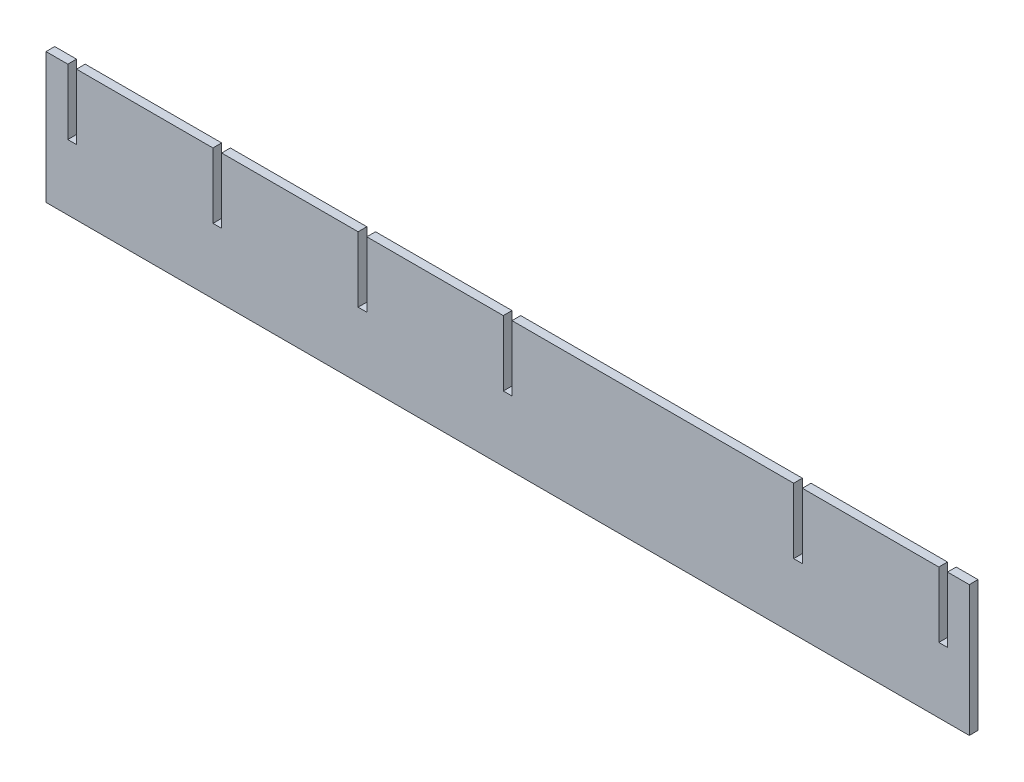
from build123d import *

# Parameters (mm, degrees)
BOSS_EXTRUDE1_DEPTH = 12


with BuildPart() as part:
    # Sketch3 → Boss-Extrude1 (new body)
    with BuildSketch(Plane(origin=(0, 0, 0), x_dir=(0, 1, 0), z_dir=(0, 0, 1))):
        Polygon((0, -394), (90, -394), (90, -6), (0, -6), (0, 6), (90, 6), (90, 194), (0, 194), (0, 206), (90, 206), (90, 394), (0, 394), (0, 406), (90, 406), (90, 594), (0, 594), (0, 606), (90, 606), (90, 636), (-90, 636), (-90, -636), (90, -636), (90, -606), (0, -606), (0, -594), (90, -594), (90, -406), (0, -406), align=None)
    extrude(amount=BOSS_EXTRUDE1_DEPTH)


solid = part.part
